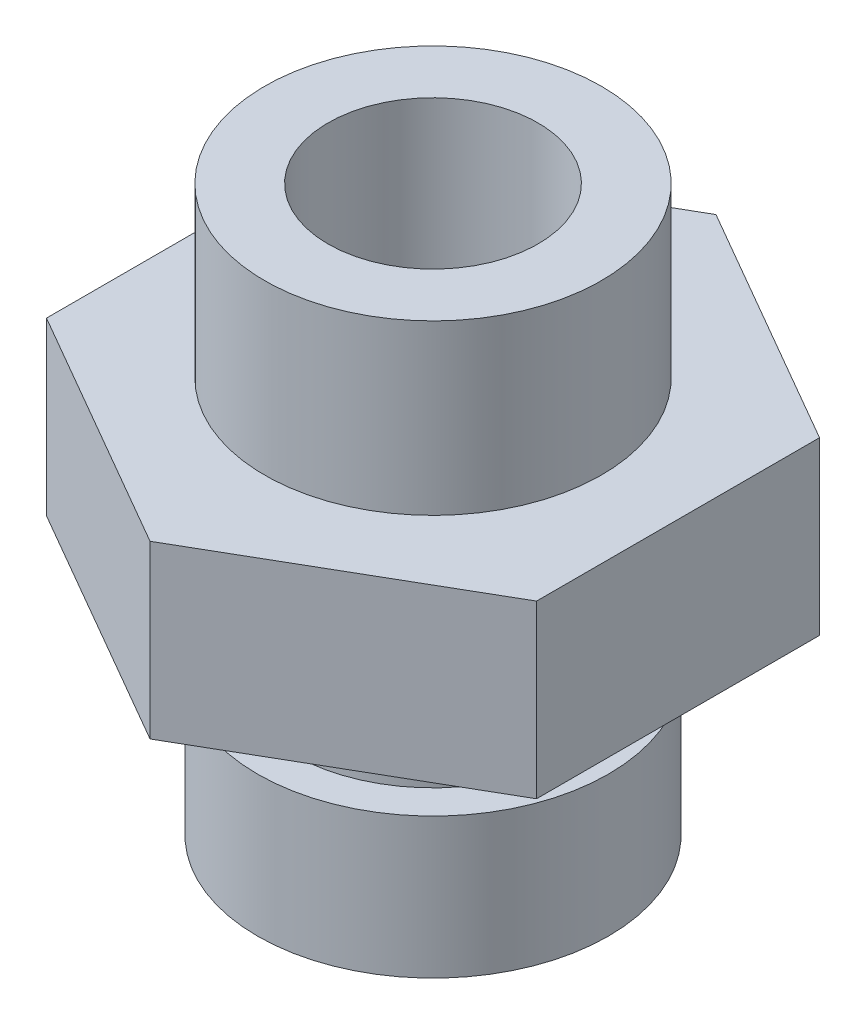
from build123d import *

# Parameters (mm, degrees)
EXTRUDE1_DEPTH     = 3.8735
SKETCH2_R          = 3.1877
EXTRUDE2_DEPTH     = 1.905
SKETCH3_R          = 3.96875
EXTRUDE3_DEPTH     = 3.175
SKETCH4_R          = 3.81
EXTRUDE4_DEPTH     = 3.81
SKETCH5_R          = 1.7272
CUT_EXTRUDE1_DEPTH = 16.317064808
SKETCH6_R          = 2.3749
CUT_EXTRUDE2_DEPTH = 5.08


with BuildPart() as part:
    # Sketch1 → Extrude1 (new body)
    with BuildSketch(Plane(origin=(0, 0, 0), x_dir=(1, 0, 0), z_dir=(0, 1, 0))):
        Polygon((-2.771775, -4.800855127), (-5.54355, -3.200570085), (-5.54355, 3.200570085), (-2.771775, 4.800855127), (0, 6.40114017), (2.771775, 4.800855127), (5.54355, 3.200570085), (5.54355, -3.200570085), (2.771775, -4.800855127), (0, -6.40114017), align=None)
    extrude(amount=EXTRUDE1_DEPTH)

    # Sketch2 → Extrude2 (add)
    with BuildSketch(Plane.XZ):
        with Locations(Location((0, 0, 0), (0, 0, 90))):
            Circle(SKETCH2_R)
    extrude(amount=EXTRUDE2_DEPTH)

    # Sketch3 → Extrude3 (add)
    with BuildSketch(Plane.XZ.offset(1.905)):
        with Locations(Location((0, 0, 0), (0, 0, 270))):
            Circle(SKETCH3_R)
    extrude(amount=EXTRUDE3_DEPTH)

    # Sketch4 → Extrude4 (add)
    with BuildSketch(Plane(origin=(0, 3.8735, 0), x_dir=(-1, 0, 0), z_dir=(0, 1, 0))):
        with Locations(Location((0, 0, 0), (0, 0, 270))):
            Circle(SKETCH4_R)
    extrude(amount=EXTRUDE4_DEPTH)

    # Sketch5 → Cut-Extrude1 (cut, through all)
    with BuildSketch(Plane(origin=(0, 7.6835, 0), x_dir=(-1, 0, 0), z_dir=(0, 1, 0))):
        with Locations(Location((0, 0, 0), (0, 0, 90))):
            Circle(SKETCH5_R)
    extrude(amount=-CUT_EXTRUDE1_DEPTH, mode=Mode.SUBTRACT)

    # Sketch6 → Cut-Extrude2 (cut)
    with BuildSketch(Plane(origin=(0, 7.6835, 0), x_dir=(-1, 0, 0), z_dir=(0, 1, 0))):
        with Locations(Location((0, 0, 0), (0, 0, 90))):
            Circle(SKETCH6_R)
    extrude(amount=-CUT_EXTRUDE2_DEPTH, mode=Mode.SUBTRACT)


solid = part.part
